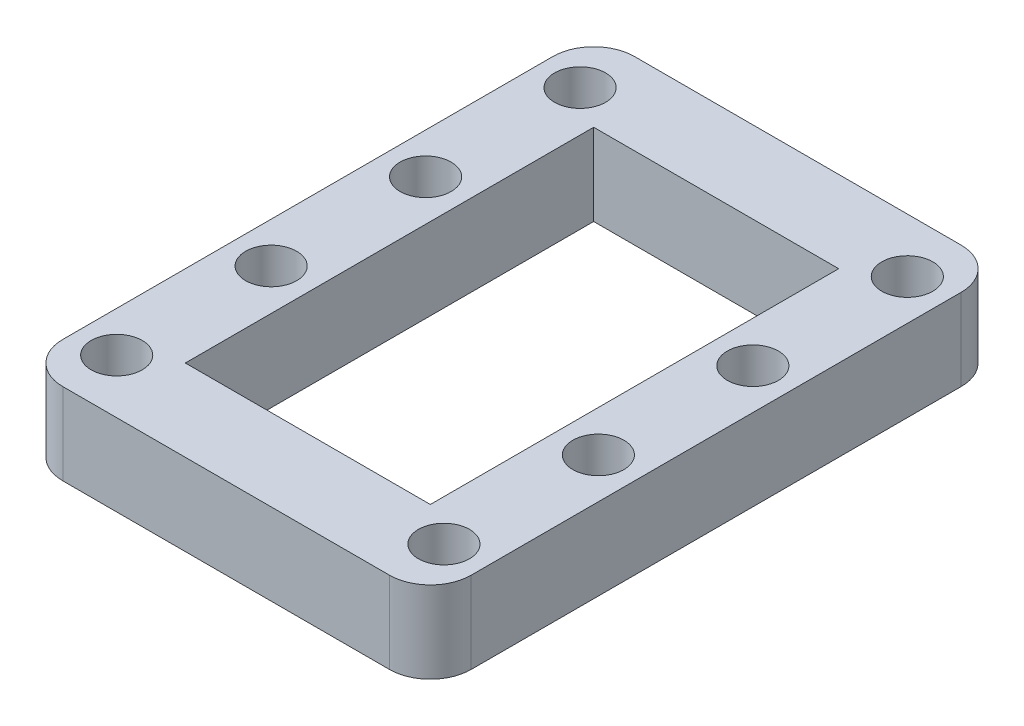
ISO-10303-21;
HEADER;
FILE_DESCRIPTION(('STEP AP214'),'2;1');
FILE_NAME('part.step','',(''),(''),'','','');
FILE_SCHEMA(('AUTOMOTIVE_DESIGN { 1 0 10303 214 1 1 1 1 }'));
ENDSEC;
DATA;
#1=APPLICATION_CONTEXT('core data for automotive mechanical design processes');
#2=APPLICATION_PROTOCOL_DEFINITION('international standard','automotive_design',2000,#1);
#3=PRODUCT_CONTEXT('',#1,'mechanical');
#4=PRODUCT('Part','Part','',(#3));
#5=PRODUCT_RELATED_PRODUCT_CATEGORY('part','',(#4));
#6=PRODUCT_DEFINITION_FORMATION('','',#4);
#7=PRODUCT_DEFINITION_CONTEXT('part definition',#1,'design');
#8=PRODUCT_DEFINITION('design','',#6,#7);
#9=PRODUCT_DEFINITION_SHAPE('','',#8);
#10=(LENGTH_UNIT() NAMED_UNIT(*) SI_UNIT(.MILLI.,.METRE.));
#11=(NAMED_UNIT(*) PLANE_ANGLE_UNIT() SI_UNIT($,.RADIAN.));
#12=(NAMED_UNIT(*) SI_UNIT($,.STERADIAN.) SOLID_ANGLE_UNIT());
#13=UNCERTAINTY_MEASURE_WITH_UNIT(LENGTH_MEASURE(1.E-05),#10,'distance_accuracy_value','');
#14=(GEOMETRIC_REPRESENTATION_CONTEXT(3) GLOBAL_UNCERTAINTY_ASSIGNED_CONTEXT((#13)) GLOBAL_UNIT_ASSIGNED_CONTEXT((#10,
#11,#12)) REPRESENTATION_CONTEXT('',''));
#15=CARTESIAN_POINT('',(0.,0.,0.));
#16=DIRECTION('',(0.,0.,1.));
#17=DIRECTION('',(1.,0.,0.));
#18=AXIS2_PLACEMENT_3D('',#15,#16,#17);
#19=CARTESIAN_POINT('',(0.,8.,0.));
#20=DIRECTION('',(0.,1.,0.));
#21=DIRECTION('',(1.,0.,0.));
#22=AXIS2_PLACEMENT_3D('',#19,#20,#21);
#23=PLANE('',#22);
#24=CARTESIAN_POINT('',(-16.0270440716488,8.,22.695));
#25=DIRECTION('',(0.,1.,0.));
#26=DIRECTION('',(0.,0.,1.));
#27=AXIS2_PLACEMENT_3D('',#24,#25,#26);
#28=CIRCLE('',#27,2.49999999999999);
#29=CARTESIAN_POINT('',(-16.0270440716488,8.,25.195));
#30=VERTEX_POINT('',#29);
#31=EDGE_CURVE('E493',#30,#30,#28,.T.);
#32=ORIENTED_EDGE('',*,*,#31,.F.);
#33=EDGE_LOOP('',(#32));
#34=FACE_BOUND('',#33,.T.);
#35=CARTESIAN_POINT('',(16.0270440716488,8.,7.565));
#36=DIRECTION('',(0.,-1.,0.));
#37=DIRECTION('',(0.,0.,-1.));
#38=AXIS2_PLACEMENT_3D('',#35,#36,#37);
#39=CIRCLE('',#38,2.50000000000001);
#40=CARTESIAN_POINT('',(16.0270440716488,8.,5.06499999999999));
#41=VERTEX_POINT('',#40);
#42=EDGE_CURVE('E507',#41,#41,#39,.T.);
#43=ORIENTED_EDGE('',*,*,#42,.T.);
#44=EDGE_LOOP('',(#43));
#45=FACE_BOUND('',#44,.T.);
#46=CARTESIAN_POINT('',(16.0270440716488,8.,-22.695));
#47=DIRECTION('',(0.,-1.,0.));
#48=DIRECTION('',(0.,0.,-1.));
#49=AXIS2_PLACEMENT_3D('',#46,#47,#48);
#50=CIRCLE('',#49,2.50000000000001);
#51=CARTESIAN_POINT('',(16.0270440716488,8.,-25.195));
#52=VERTEX_POINT('',#51);
#53=EDGE_CURVE('E539',#52,#52,#50,.T.);
#54=ORIENTED_EDGE('',*,*,#53,.T.);
#55=EDGE_LOOP('',(#54));
#56=FACE_BOUND('',#55,.T.);
#57=CARTESIAN_POINT('',(-16.0270440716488,8.,7.565));
#58=DIRECTION('',(0.,1.,0.));
#59=DIRECTION('',(0.,0.,1.));
#60=AXIS2_PLACEMENT_3D('',#57,#58,#59);
#61=CIRCLE('',#60,2.49999999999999);
#62=CARTESIAN_POINT('',(-16.0270440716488,8.,10.065));
#63=VERTEX_POINT('',#62);
#64=EDGE_CURVE('E286',#63,#63,#61,.T.);
#65=ORIENTED_EDGE('',*,*,#64,.F.);
#66=EDGE_LOOP('',(#65));
#67=FACE_BOUND('',#66,.T.);
#68=CARTESIAN_POINT('',(16.,8.,24.));
#69=DIRECTION('',(0.,1.,0.));
#70=DIRECTION('',(0.,0.,1.));
#71=AXIS2_PLACEMENT_3D('',#68,#69,#70);
#72=CIRCLE('',#71,4.);
#73=CARTESIAN_POINT('',(16.,8.,28.));
#74=VERTEX_POINT('',#73);
#75=CARTESIAN_POINT('',(20.,8.,24.));
#76=VERTEX_POINT('',#75);
#77=EDGE_CURVE('E164',#74,#76,#72,.T.);
#78=ORIENTED_EDGE('',*,*,#77,.T.);
#79=DIRECTION('',(0.,0.,-1.));
#80=VECTOR('',#79,1.);
#81=CARTESIAN_POINT('',(20.,8.,24.));
#82=LINE('',#81,#80);
#83=CARTESIAN_POINT('',(20.,8.,-24.));
#84=VERTEX_POINT('',#83);
#85=EDGE_CURVE('E160',#76,#84,#82,.T.);
#86=ORIENTED_EDGE('',*,*,#85,.T.);
#87=CARTESIAN_POINT('',(16.,8.,-24.));
#88=DIRECTION('',(0.,1.,0.));
#89=DIRECTION('',(0.,0.,1.));
#90=AXIS2_PLACEMENT_3D('',#87,#88,#89);
#91=CIRCLE('',#90,4.);
#92=CARTESIAN_POINT('',(16.,8.,-28.));
#93=VERTEX_POINT('',#92);
#94=EDGE_CURVE('E115',#84,#93,#91,.T.);
#95=ORIENTED_EDGE('',*,*,#94,.T.);
#96=DIRECTION('',(-1.,0.,0.));
#97=VECTOR('',#96,1.);
#98=CARTESIAN_POINT('',(16.,8.,-28.));
#99=LINE('',#98,#97);
#100=CARTESIAN_POINT('',(-16.,8.,-28.));
#101=VERTEX_POINT('',#100);
#102=EDGE_CURVE('E42',#93,#101,#99,.T.);
#103=ORIENTED_EDGE('',*,*,#102,.T.);
#104=CARTESIAN_POINT('',(-16.,8.,-24.));
#105=DIRECTION('',(0.,1.,0.));
#106=DIRECTION('',(0.,0.,-1.));
#107=AXIS2_PLACEMENT_3D('',#104,#105,#106);
#108=CIRCLE('',#107,4.);
#109=CARTESIAN_POINT('',(-20.,8.,-24.));
#110=VERTEX_POINT('',#109);
#111=EDGE_CURVE('E203',#101,#110,#108,.T.);
#112=ORIENTED_EDGE('',*,*,#111,.T.);
#113=DIRECTION('',(0.,0.,1.));
#114=VECTOR('',#113,1.);
#115=CARTESIAN_POINT('',(-20.,8.,-24.));
#116=LINE('',#115,#114);
#117=CARTESIAN_POINT('',(-20.,8.,24.));
#118=VERTEX_POINT('',#117);
#119=EDGE_CURVE('E174',#110,#118,#116,.T.);
#120=ORIENTED_EDGE('',*,*,#119,.T.);
#121=CARTESIAN_POINT('',(-16.,8.,24.));
#122=DIRECTION('',(0.,1.,0.));
#123=DIRECTION('',(0.,0.,-1.));
#124=AXIS2_PLACEMENT_3D('',#121,#122,#123);
#125=CIRCLE('',#124,4.);
#126=CARTESIAN_POINT('',(-16.,8.,28.));
#127=VERTEX_POINT('',#126);
#128=EDGE_CURVE('E172',#118,#127,#125,.T.);
#129=ORIENTED_EDGE('',*,*,#128,.T.);
#130=DIRECTION('',(1.,0.,0.));
#131=VECTOR('',#130,1.);
#132=CARTESIAN_POINT('',(-16.,8.,28.));
#133=LINE('',#132,#131);
#134=EDGE_CURVE('E132',#127,#74,#133,.T.);
#135=ORIENTED_EDGE('',*,*,#134,.T.);
#136=EDGE_LOOP('',(#78,#86,#95,#103,#112,#120,#129,#135));
#137=FACE_BOUND('',#136,.T.);
#138=DIRECTION('',(1.,0.,0.));
#139=VECTOR('',#138,1.);
#140=CARTESIAN_POINT('',(-16.,8.,-20.));
#141=LINE('',#140,#139);
#142=CARTESIAN_POINT('',(-12.,8.,-20.));
#143=VERTEX_POINT('',#142);
#144=CARTESIAN_POINT('',(12.,8.,-20.));
#145=VERTEX_POINT('',#144);
#146=EDGE_CURVE('E219',#143,#145,#141,.T.);
#147=ORIENTED_EDGE('',*,*,#146,.T.);
#148=DIRECTION('',(0.,0.,1.));
#149=VECTOR('',#148,1.);
#150=CARTESIAN_POINT('',(12.,8.,-24.));
#151=LINE('',#150,#149);
#152=CARTESIAN_POINT('',(12.,8.,20.));
#153=VERTEX_POINT('',#152);
#154=EDGE_CURVE('E221',#145,#153,#151,.T.);
#155=ORIENTED_EDGE('',*,*,#154,.T.);
#156=DIRECTION('',(-1.,0.,0.));
#157=VECTOR('',#156,1.);
#158=CARTESIAN_POINT('',(16.,8.,20.));
#159=LINE('',#158,#157);
#160=CARTESIAN_POINT('',(-12.,8.,20.));
#161=VERTEX_POINT('',#160);
#162=EDGE_CURVE('E157',#153,#161,#159,.T.);
#163=ORIENTED_EDGE('',*,*,#162,.T.);
#164=DIRECTION('',(0.,0.,-1.));
#165=VECTOR('',#164,1.);
#166=CARTESIAN_POINT('',(-12.,8.,24.));
#167=LINE('',#166,#165);
#168=EDGE_CURVE('E177',#161,#143,#167,.T.);
#169=ORIENTED_EDGE('',*,*,#168,.T.);
#170=EDGE_LOOP('',(#147,#155,#163,#169));
#171=FACE_BOUND('',#170,.T.);
#172=CARTESIAN_POINT('',(-16.0270440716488,8.,-22.695));
#173=DIRECTION('',(0.,1.,0.));
#174=DIRECTION('',(0.,0.,1.));
#175=AXIS2_PLACEMENT_3D('',#172,#173,#174);
#176=CIRCLE('',#175,2.49999999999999);
#177=CARTESIAN_POINT('',(-16.0270440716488,8.,-20.195));
#178=VERTEX_POINT('',#177);
#179=EDGE_CURVE('E532',#178,#178,#176,.T.);
#180=ORIENTED_EDGE('',*,*,#179,.F.);
#181=EDGE_LOOP('',(#180));
#182=FACE_BOUND('',#181,.T.);
#183=CARTESIAN_POINT('',(-16.0270440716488,8.,-7.565));
#184=DIRECTION('',(0.,1.,0.));
#185=DIRECTION('',(0.,0.,1.));
#186=AXIS2_PLACEMENT_3D('',#183,#184,#185);
#187=CIRCLE('',#186,2.49999999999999);
#188=CARTESIAN_POINT('',(-16.0270440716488,8.,-5.065));
#189=VERTEX_POINT('',#188);
#190=EDGE_CURVE('E518',#189,#189,#187,.T.);
#191=ORIENTED_EDGE('',*,*,#190,.F.);
#192=EDGE_LOOP('',(#191));
#193=FACE_BOUND('',#192,.T.);
#194=CARTESIAN_POINT('',(16.0270440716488,8.,-7.565));
#195=DIRECTION('',(0.,-1.,0.));
#196=DIRECTION('',(0.,0.,-1.));
#197=AXIS2_PLACEMENT_3D('',#194,#195,#196);
#198=CIRCLE('',#197,2.50000000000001);
#199=CARTESIAN_POINT('',(16.0270440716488,8.,-10.065));
#200=VERTEX_POINT('',#199);
#201=EDGE_CURVE('E513',#200,#200,#198,.T.);
#202=ORIENTED_EDGE('',*,*,#201,.T.);
#203=EDGE_LOOP('',(#202));
#204=FACE_BOUND('',#203,.T.);
#205=CARTESIAN_POINT('',(16.0270440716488,8.,22.695));
#206=DIRECTION('',(0.,-1.,0.));
#207=DIRECTION('',(0.,0.,-1.));
#208=AXIS2_PLACEMENT_3D('',#205,#206,#207);
#209=CIRCLE('',#208,2.50000000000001);
#210=CARTESIAN_POINT('',(16.0270440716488,8.,20.195));
#211=VERTEX_POINT('',#210);
#212=EDGE_CURVE('E496',#211,#211,#209,.T.);
#213=ORIENTED_EDGE('',*,*,#212,.T.);
#214=EDGE_LOOP('',(#213));
#215=FACE_BOUND('',#214,.T.);
#216=ADVANCED_FACE('F38',(#34,#45,#56,#67,#137,#171,#182,#193,#204,#215),#23,.T.);
#217=CARTESIAN_POINT('',(0.,0.,0.));
#218=DIRECTION('',(0.,1.,0.));
#219=DIRECTION('',(1.,0.,0.));
#220=AXIS2_PLACEMENT_3D('',#217,#218,#219);
#221=PLANE('',#220);
#222=CARTESIAN_POINT('',(-16.0270440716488,0.,22.695));
#223=DIRECTION('',(0.,1.,0.));
#224=DIRECTION('',(0.,0.,1.));
#225=AXIS2_PLACEMENT_3D('',#222,#223,#224);
#226=CIRCLE('',#225,2.49999999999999);
#227=CARTESIAN_POINT('',(-16.0270440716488,0.,25.195));
#228=VERTEX_POINT('',#227);
#229=EDGE_CURVE('E491',#228,#228,#226,.T.);
#230=ORIENTED_EDGE('',*,*,#229,.T.);
#231=EDGE_LOOP('',(#230));
#232=FACE_BOUND('',#231,.T.);
#233=CARTESIAN_POINT('',(-16.0270440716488,0.,-7.565));
#234=DIRECTION('',(0.,1.,0.));
#235=DIRECTION('',(0.,0.,1.));
#236=AXIS2_PLACEMENT_3D('',#233,#234,#235);
#237=CIRCLE('',#236,2.49999999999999);
#238=CARTESIAN_POINT('',(-16.0270440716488,0.,-5.065));
#239=VERTEX_POINT('',#238);
#240=EDGE_CURVE('E527',#239,#239,#237,.T.);
#241=ORIENTED_EDGE('',*,*,#240,.T.);
#242=EDGE_LOOP('',(#241));
#243=FACE_BOUND('',#242,.T.);
#244=CARTESIAN_POINT('',(-16.0270440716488,0.,-22.695));
#245=DIRECTION('',(0.,1.,0.));
#246=DIRECTION('',(0.,0.,1.));
#247=AXIS2_PLACEMENT_3D('',#244,#245,#246);
#248=CIRCLE('',#247,2.49999999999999);
#249=CARTESIAN_POINT('',(-16.0270440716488,0.,-20.195));
#250=VERTEX_POINT('',#249);
#251=EDGE_CURVE('E537',#250,#250,#248,.T.);
#252=ORIENTED_EDGE('',*,*,#251,.T.);
#253=EDGE_LOOP('',(#252));
#254=FACE_BOUND('',#253,.T.);
#255=CARTESIAN_POINT('',(-16.0270440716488,0.,7.565));
#256=DIRECTION('',(0.,1.,0.));
#257=DIRECTION('',(0.,0.,1.));
#258=AXIS2_PLACEMENT_3D('',#255,#256,#257);
#259=CIRCLE('',#258,2.49999999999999);
#260=CARTESIAN_POINT('',(-16.0270440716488,0.,10.065));
#261=VERTEX_POINT('',#260);
#262=EDGE_CURVE('E179',#261,#261,#259,.T.);
#263=ORIENTED_EDGE('',*,*,#262,.T.);
#264=EDGE_LOOP('',(#263));
#265=FACE_BOUND('',#264,.T.);
#266=CARTESIAN_POINT('',(16.,0.,24.));
#267=DIRECTION('',(0.,1.,0.));
#268=DIRECTION('',(0.,0.,1.));
#269=AXIS2_PLACEMENT_3D('',#266,#267,#268);
#270=CIRCLE('',#269,4.);
#271=CARTESIAN_POINT('',(16.,0.,28.));
#272=VERTEX_POINT('',#271);
#273=CARTESIAN_POINT('',(20.,0.,24.));
#274=VERTEX_POINT('',#273);
#275=EDGE_CURVE('E146',#272,#274,#270,.T.);
#276=ORIENTED_EDGE('',*,*,#275,.F.);
#277=DIRECTION('',(1.,0.,0.));
#278=VECTOR('',#277,1.);
#279=CARTESIAN_POINT('',(-16.,0.,28.));
#280=LINE('',#279,#278);
#281=CARTESIAN_POINT('',(-16.,0.,28.));
#282=VERTEX_POINT('',#281);
#283=EDGE_CURVE('E130',#282,#272,#280,.T.);
#284=ORIENTED_EDGE('',*,*,#283,.F.);
#285=CARTESIAN_POINT('',(-16.,0.,24.));
#286=DIRECTION('',(0.,1.,0.));
#287=DIRECTION('',(0.,0.,-1.));
#288=AXIS2_PLACEMENT_3D('',#285,#286,#287);
#289=CIRCLE('',#288,4.);
#290=CARTESIAN_POINT('',(-20.,0.,24.));
#291=VERTEX_POINT('',#290);
#292=EDGE_CURVE('E136',#291,#282,#289,.T.);
#293=ORIENTED_EDGE('',*,*,#292,.F.);
#294=DIRECTION('',(0.,0.,1.));
#295=VECTOR('',#294,1.);
#296=CARTESIAN_POINT('',(-20.,0.,-24.));
#297=LINE('',#296,#295);
#298=CARTESIAN_POINT('',(-20.,0.,-24.));
#299=VERTEX_POINT('',#298);
#300=EDGE_CURVE('E137',#299,#291,#297,.T.);
#301=ORIENTED_EDGE('',*,*,#300,.F.);
#302=CARTESIAN_POINT('',(-16.,0.,-24.));
#303=DIRECTION('',(0.,1.,0.));
#304=DIRECTION('',(0.,0.,-1.));
#305=AXIS2_PLACEMENT_3D('',#302,#303,#304);
#306=CIRCLE('',#305,4.);
#307=CARTESIAN_POINT('',(-16.,0.,-28.));
#308=VERTEX_POINT('',#307);
#309=EDGE_CURVE('E207',#308,#299,#306,.T.);
#310=ORIENTED_EDGE('',*,*,#309,.F.);
#311=DIRECTION('',(-1.,0.,0.));
#312=VECTOR('',#311,1.);
#313=CARTESIAN_POINT('',(16.,0.,-28.));
#314=LINE('',#313,#312);
#315=CARTESIAN_POINT('',(16.,0.,-28.));
#316=VERTEX_POINT('',#315);
#317=EDGE_CURVE('E216',#316,#308,#314,.T.);
#318=ORIENTED_EDGE('',*,*,#317,.F.);
#319=CARTESIAN_POINT('',(16.,0.,-24.));
#320=DIRECTION('',(0.,1.,0.));
#321=DIRECTION('',(0.,0.,1.));
#322=AXIS2_PLACEMENT_3D('',#319,#320,#321);
#323=CIRCLE('',#322,4.);
#324=CARTESIAN_POINT('',(20.,0.,-24.));
#325=VERTEX_POINT('',#324);
#326=EDGE_CURVE('E197',#325,#316,#323,.T.);
#327=ORIENTED_EDGE('',*,*,#326,.F.);
#328=DIRECTION('',(0.,0.,-1.));
#329=VECTOR('',#328,1.);
#330=CARTESIAN_POINT('',(20.,0.,24.));
#331=LINE('',#330,#329);
#332=EDGE_CURVE('E171',#274,#325,#331,.T.);
#333=ORIENTED_EDGE('',*,*,#332,.F.);
#334=EDGE_LOOP('',(#276,#284,#293,#301,#310,#318,#327,#333));
#335=FACE_BOUND('',#334,.T.);
#336=DIRECTION('',(1.,0.,0.));
#337=VECTOR('',#336,1.);
#338=CARTESIAN_POINT('',(-16.,0.,-20.));
#339=LINE('',#338,#337);
#340=CARTESIAN_POINT('',(-12.,0.,-20.));
#341=VERTEX_POINT('',#340);
#342=CARTESIAN_POINT('',(12.,0.,-20.));
#343=VERTEX_POINT('',#342);
#344=EDGE_CURVE('E191',#341,#343,#339,.T.);
#345=ORIENTED_EDGE('',*,*,#344,.F.);
#346=DIRECTION('',(0.,0.,-1.));
#347=VECTOR('',#346,1.);
#348=CARTESIAN_POINT('',(-12.,0.,24.));
#349=LINE('',#348,#347);
#350=CARTESIAN_POINT('',(-12.,0.,20.));
#351=VERTEX_POINT('',#350);
#352=EDGE_CURVE('E11',#351,#341,#349,.T.);
#353=ORIENTED_EDGE('',*,*,#352,.F.);
#354=DIRECTION('',(-1.,0.,0.));
#355=VECTOR('',#354,1.);
#356=CARTESIAN_POINT('',(16.,0.,20.));
#357=LINE('',#356,#355);
#358=CARTESIAN_POINT('',(12.,0.,20.));
#359=VERTEX_POINT('',#358);
#360=EDGE_CURVE('E165',#359,#351,#357,.T.);
#361=ORIENTED_EDGE('',*,*,#360,.F.);
#362=DIRECTION('',(0.,0.,1.));
#363=VECTOR('',#362,1.);
#364=CARTESIAN_POINT('',(12.,0.,-24.));
#365=LINE('',#364,#363);
#366=EDGE_CURVE('E181',#343,#359,#365,.T.);
#367=ORIENTED_EDGE('',*,*,#366,.F.);
#368=EDGE_LOOP('',(#345,#353,#361,#367));
#369=FACE_BOUND('',#368,.T.);
#370=CARTESIAN_POINT('',(16.0270440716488,0.,-22.695));
#371=DIRECTION('',(0.,-1.,0.));
#372=DIRECTION('',(0.,0.,-1.));
#373=AXIS2_PLACEMENT_3D('',#370,#371,#372);
#374=CIRCLE('',#373,2.50000000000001);
#375=CARTESIAN_POINT('',(16.0270440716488,0.,-25.195));
#376=VERTEX_POINT('',#375);
#377=EDGE_CURVE('E499',#376,#376,#374,.T.);
#378=ORIENTED_EDGE('',*,*,#377,.F.);
#379=EDGE_LOOP('',(#378));
#380=FACE_BOUND('',#379,.T.);
#381=CARTESIAN_POINT('',(16.0270440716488,0.,-7.565));
#382=DIRECTION('',(0.,-1.,0.));
#383=DIRECTION('',(0.,0.,-1.));
#384=AXIS2_PLACEMENT_3D('',#381,#382,#383);
#385=CIRCLE('',#384,2.50000000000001);
#386=CARTESIAN_POINT('',(16.0270440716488,0.,-10.065));
#387=VERTEX_POINT('',#386);
#388=EDGE_CURVE('E516',#387,#387,#385,.T.);
#389=ORIENTED_EDGE('',*,*,#388,.F.);
#390=EDGE_LOOP('',(#389));
#391=FACE_BOUND('',#390,.T.);
#392=CARTESIAN_POINT('',(16.0270440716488,0.,7.565));
#393=DIRECTION('',(0.,-1.,0.));
#394=DIRECTION('',(0.,0.,-1.));
#395=AXIS2_PLACEMENT_3D('',#392,#393,#394);
#396=CIRCLE('',#395,2.50000000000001);
#397=CARTESIAN_POINT('',(16.0270440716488,0.,5.06499999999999));
#398=VERTEX_POINT('',#397);
#399=EDGE_CURVE('E510',#398,#398,#396,.T.);
#400=ORIENTED_EDGE('',*,*,#399,.F.);
#401=EDGE_LOOP('',(#400));
#402=FACE_BOUND('',#401,.T.);
#403=CARTESIAN_POINT('',(16.0270440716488,0.,22.695));
#404=DIRECTION('',(0.,-1.,0.));
#405=DIRECTION('',(0.,0.,-1.));
#406=AXIS2_PLACEMENT_3D('',#403,#404,#405);
#407=CIRCLE('',#406,2.50000000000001);
#408=CARTESIAN_POINT('',(16.0270440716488,0.,20.195));
#409=VERTEX_POINT('',#408);
#410=EDGE_CURVE('E504',#409,#409,#407,.T.);
#411=ORIENTED_EDGE('',*,*,#410,.F.);
#412=EDGE_LOOP('',(#411));
#413=FACE_BOUND('',#412,.T.);
#414=ADVANCED_FACE('F140',(#232,#243,#254,#265,#335,#369,#380,#391,#402,#413),#221,.F.);
#415=CARTESIAN_POINT('',(-12.,0.,20.));
#416=DIRECTION('',(1.,0.,0.));
#417=DIRECTION('',(0.,1.,0.));
#418=AXIS2_PLACEMENT_3D('',#415,#416,#417);
#419=PLANE('',#418);
#420=ORIENTED_EDGE('',*,*,#352,.T.);
#421=DIRECTION('',(0.,1.,0.));
#422=VECTOR('',#421,1.);
#423=CARTESIAN_POINT('',(-12.,0.,-20.));
#424=LINE('',#423,#422);
#425=EDGE_CURVE('E48',#341,#143,#424,.T.);
#426=ORIENTED_EDGE('',*,*,#425,.T.);
#427=ORIENTED_EDGE('',*,*,#168,.F.);
#428=DIRECTION('',(0.,1.,0.));
#429=VECTOR('',#428,1.);
#430=CARTESIAN_POINT('',(-12.,0.,20.));
#431=LINE('',#430,#429);
#432=EDGE_CURVE('E168',#351,#161,#431,.T.);
#433=ORIENTED_EDGE('',*,*,#432,.F.);
#434=EDGE_LOOP('',(#420,#426,#427,#433));
#435=FACE_BOUND('',#434,.T.);
#436=ADVANCED_FACE('F256',(#435),#419,.T.);
#437=CARTESIAN_POINT('',(12.,0.,20.));
#438=DIRECTION('',(0.,0.,-1.));
#439=DIRECTION('',(0.,-1.,0.));
#440=AXIS2_PLACEMENT_3D('',#437,#438,#439);
#441=PLANE('',#440);
#442=ORIENTED_EDGE('',*,*,#360,.T.);
#443=ORIENTED_EDGE('',*,*,#432,.T.);
#444=ORIENTED_EDGE('',*,*,#162,.F.);
#445=DIRECTION('',(0.,1.,0.));
#446=VECTOR('',#445,1.);
#447=CARTESIAN_POINT('',(12.,0.,20.));
#448=LINE('',#447,#446);
#449=EDGE_CURVE('E186',#359,#153,#448,.T.);
#450=ORIENTED_EDGE('',*,*,#449,.F.);
#451=EDGE_LOOP('',(#442,#443,#444,#450));
#452=FACE_BOUND('',#451,.T.);
#453=ADVANCED_FACE('F269',(#452),#441,.T.);
#454=CARTESIAN_POINT('',(12.,0.,-20.));
#455=DIRECTION('',(-1.,0.,0.));
#456=DIRECTION('',(0.,0.,1.));
#457=AXIS2_PLACEMENT_3D('',#454,#455,#456);
#458=PLANE('',#457);
#459=ORIENTED_EDGE('',*,*,#366,.T.);
#460=ORIENTED_EDGE('',*,*,#449,.T.);
#461=ORIENTED_EDGE('',*,*,#154,.F.);
#462=DIRECTION('',(0.,1.,0.));
#463=VECTOR('',#462,1.);
#464=CARTESIAN_POINT('',(12.,0.,-20.));
#465=LINE('',#464,#463);
#466=EDGE_CURVE('E147',#343,#145,#465,.T.);
#467=ORIENTED_EDGE('',*,*,#466,.F.);
#468=EDGE_LOOP('',(#459,#460,#461,#467));
#469=FACE_BOUND('',#468,.T.);
#470=ADVANCED_FACE('F266',(#469),#458,.T.);
#471=CARTESIAN_POINT('',(-12.,0.,-20.));
#472=DIRECTION('',(0.,0.,1.));
#473=DIRECTION('',(1.,0.,0.));
#474=AXIS2_PLACEMENT_3D('',#471,#472,#473);
#475=PLANE('',#474);
#476=ORIENTED_EDGE('',*,*,#344,.T.);
#477=ORIENTED_EDGE('',*,*,#466,.T.);
#478=ORIENTED_EDGE('',*,*,#146,.F.);
#479=ORIENTED_EDGE('',*,*,#425,.F.);
#480=EDGE_LOOP('',(#476,#477,#478,#479));
#481=FACE_BOUND('',#480,.T.);
#482=ADVANCED_FACE('F265',(#481),#475,.T.);
#483=CARTESIAN_POINT('',(-16.,0.,28.));
#484=DIRECTION('',(0.,0.,1.));
#485=DIRECTION('',(1.,0.,0.));
#486=AXIS2_PLACEMENT_3D('',#483,#484,#485);
#487=PLANE('',#486);
#488=ORIENTED_EDGE('',*,*,#283,.T.);
#489=DIRECTION('',(0.,1.,0.));
#490=VECTOR('',#489,1.);
#491=CARTESIAN_POINT('',(16.,0.,28.));
#492=LINE('',#491,#490);
#493=EDGE_CURVE('E148',#272,#74,#492,.T.);
#494=ORIENTED_EDGE('',*,*,#493,.T.);
#495=ORIENTED_EDGE('',*,*,#134,.F.);
#496=DIRECTION('',(0.,1.,0.));
#497=VECTOR('',#496,1.);
#498=CARTESIAN_POINT('',(-16.,0.,28.));
#499=LINE('',#498,#497);
#500=EDGE_CURVE('E126',#282,#127,#499,.T.);
#501=ORIENTED_EDGE('',*,*,#500,.F.);
#502=EDGE_LOOP('',(#488,#494,#495,#501));
#503=FACE_BOUND('',#502,.T.);
#504=ADVANCED_FACE('F128',(#503),#487,.T.);
#505=CARTESIAN_POINT('',(-16.,0.,24.));
#506=DIRECTION('',(0.,1.,0.));
#507=DIRECTION('',(0.,0.,-1.));
#508=AXIS2_PLACEMENT_3D('',#505,#506,#507);
#509=CYLINDRICAL_SURFACE('',#508,4.);
#510=ORIENTED_EDGE('',*,*,#292,.T.);
#511=ORIENTED_EDGE('',*,*,#500,.T.);
#512=ORIENTED_EDGE('',*,*,#128,.F.);
#513=DIRECTION('',(0.,1.,0.));
#514=VECTOR('',#513,1.);
#515=CARTESIAN_POINT('',(-20.,0.,24.));
#516=LINE('',#515,#514);
#517=EDGE_CURVE('E152',#291,#118,#516,.T.);
#518=ORIENTED_EDGE('',*,*,#517,.F.);
#519=EDGE_LOOP('',(#510,#511,#512,#518));
#520=FACE_BOUND('',#519,.T.);
#521=ADVANCED_FACE('F150',(#520),#509,.T.);
#522=CARTESIAN_POINT('',(-20.,0.,-24.));
#523=DIRECTION('',(-1.,0.,0.));
#524=DIRECTION('',(0.,1.,0.));
#525=AXIS2_PLACEMENT_3D('',#522,#523,#524);
#526=PLANE('',#525);
#527=ORIENTED_EDGE('',*,*,#300,.T.);
#528=ORIENTED_EDGE('',*,*,#517,.T.);
#529=ORIENTED_EDGE('',*,*,#119,.F.);
#530=DIRECTION('',(0.,1.,0.));
#531=VECTOR('',#530,1.);
#532=CARTESIAN_POINT('',(-20.,0.,-24.));
#533=LINE('',#532,#531);
#534=EDGE_CURVE('E209',#299,#110,#533,.T.);
#535=ORIENTED_EDGE('',*,*,#534,.F.);
#536=EDGE_LOOP('',(#527,#528,#529,#535));
#537=FACE_BOUND('',#536,.T.);
#538=ADVANCED_FACE('F271',(#537),#526,.T.);
#539=CARTESIAN_POINT('',(-16.,0.,-24.));
#540=DIRECTION('',(0.,1.,0.));
#541=DIRECTION('',(0.,0.,-1.));
#542=AXIS2_PLACEMENT_3D('',#539,#540,#541);
#543=CYLINDRICAL_SURFACE('',#542,4.);
#544=ORIENTED_EDGE('',*,*,#309,.T.);
#545=ORIENTED_EDGE('',*,*,#534,.T.);
#546=ORIENTED_EDGE('',*,*,#111,.F.);
#547=DIRECTION('',(0.,1.,0.));
#548=VECTOR('',#547,1.);
#549=CARTESIAN_POINT('',(-16.,0.,-28.));
#550=LINE('',#549,#548);
#551=EDGE_CURVE('E195',#308,#101,#550,.T.);
#552=ORIENTED_EDGE('',*,*,#551,.F.);
#553=EDGE_LOOP('',(#544,#545,#546,#552));
#554=FACE_BOUND('',#553,.T.);
#555=ADVANCED_FACE('F275',(#554),#543,.T.);
#556=CARTESIAN_POINT('',(16.,0.,-28.));
#557=DIRECTION('',(0.,0.,-1.));
#558=DIRECTION('',(0.,-1.,0.));
#559=AXIS2_PLACEMENT_3D('',#556,#557,#558);
#560=PLANE('',#559);
#561=ORIENTED_EDGE('',*,*,#317,.T.);
#562=ORIENTED_EDGE('',*,*,#551,.T.);
#563=ORIENTED_EDGE('',*,*,#102,.F.);
#564=DIRECTION('',(0.,1.,0.));
#565=VECTOR('',#564,1.);
#566=CARTESIAN_POINT('',(16.,0.,-28.));
#567=LINE('',#566,#565);
#568=EDGE_CURVE('E108',#316,#93,#567,.T.);
#569=ORIENTED_EDGE('',*,*,#568,.F.);
#570=EDGE_LOOP('',(#561,#562,#563,#569));
#571=FACE_BOUND('',#570,.T.);
#572=ADVANCED_FACE('F225',(#571),#560,.T.);
#573=CARTESIAN_POINT('',(16.,0.,-24.));
#574=DIRECTION('',(0.,1.,0.));
#575=DIRECTION('',(0.,0.,1.));
#576=AXIS2_PLACEMENT_3D('',#573,#574,#575);
#577=CYLINDRICAL_SURFACE('',#576,4.);
#578=ORIENTED_EDGE('',*,*,#326,.T.);
#579=ORIENTED_EDGE('',*,*,#568,.T.);
#580=ORIENTED_EDGE('',*,*,#94,.F.);
#581=DIRECTION('',(0.,1.,0.));
#582=VECTOR('',#581,1.);
#583=CARTESIAN_POINT('',(20.,0.,-24.));
#584=LINE('',#583,#582);
#585=EDGE_CURVE('E169',#325,#84,#584,.T.);
#586=ORIENTED_EDGE('',*,*,#585,.F.);
#587=EDGE_LOOP('',(#578,#579,#580,#586));
#588=FACE_BOUND('',#587,.T.);
#589=ADVANCED_FACE('F40',(#588),#577,.T.);
#590=CARTESIAN_POINT('',(20.,0.,24.));
#591=DIRECTION('',(1.,0.,0.));
#592=DIRECTION('',(0.,1.,0.));
#593=AXIS2_PLACEMENT_3D('',#590,#591,#592);
#594=PLANE('',#593);
#595=ORIENTED_EDGE('',*,*,#332,.T.);
#596=ORIENTED_EDGE('',*,*,#585,.T.);
#597=ORIENTED_EDGE('',*,*,#85,.F.);
#598=DIRECTION('',(0.,1.,0.));
#599=VECTOR('',#598,1.);
#600=CARTESIAN_POINT('',(20.,0.,24.));
#601=LINE('',#600,#599);
#602=EDGE_CURVE('E161',#274,#76,#601,.T.);
#603=ORIENTED_EDGE('',*,*,#602,.F.);
#604=EDGE_LOOP('',(#595,#596,#597,#603));
#605=FACE_BOUND('',#604,.T.);
#606=ADVANCED_FACE('F235',(#605),#594,.T.);
#607=CARTESIAN_POINT('',(16.,0.,24.));
#608=DIRECTION('',(0.,1.,0.));
#609=DIRECTION('',(0.,0.,1.));
#610=AXIS2_PLACEMENT_3D('',#607,#608,#609);
#611=CYLINDRICAL_SURFACE('',#610,4.);
#612=ORIENTED_EDGE('',*,*,#275,.T.);
#613=ORIENTED_EDGE('',*,*,#602,.T.);
#614=ORIENTED_EDGE('',*,*,#77,.F.);
#615=ORIENTED_EDGE('',*,*,#493,.F.);
#616=EDGE_LOOP('',(#612,#613,#614,#615));
#617=FACE_BOUND('',#616,.T.);
#618=ADVANCED_FACE('F237',(#617),#611,.T.);
#619=CARTESIAN_POINT('',(-16.0270440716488,0.,7.565));
#620=DIRECTION('',(0.,1.,0.));
#621=DIRECTION('',(0.,0.,1.));
#622=AXIS2_PLACEMENT_3D('',#619,#620,#621);
#623=CYLINDRICAL_SURFACE('',#622,2.49999999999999);
#624=ORIENTED_EDGE('',*,*,#262,.F.);
#625=EDGE_LOOP('',(#624));
#626=FACE_BOUND('',#625,.T.);
#627=ORIENTED_EDGE('',*,*,#64,.T.);
#628=EDGE_LOOP('',(#627));
#629=FACE_BOUND('',#628,.T.);
#630=ADVANCED_FACE('F239',(#626,#629),#623,.F.);
#631=CARTESIAN_POINT('',(16.0270440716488,0.,-22.695));
#632=DIRECTION('',(0.,1.,0.));
#633=DIRECTION('',(0.,0.,1.));
#634=AXIS2_PLACEMENT_3D('',#631,#632,#633);
#635=CYLINDRICAL_SURFACE('',#634,2.50000000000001);
#636=ORIENTED_EDGE('',*,*,#377,.T.);
#637=EDGE_LOOP('',(#636));
#638=FACE_BOUND('',#637,.T.);
#639=ORIENTED_EDGE('',*,*,#53,.F.);
#640=EDGE_LOOP('',(#639));
#641=FACE_BOUND('',#640,.T.);
#642=ADVANCED_FACE('F245',(#638,#641),#635,.F.);
#643=CARTESIAN_POINT('',(-16.0270440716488,0.,-22.695));
#644=DIRECTION('',(0.,1.,0.));
#645=DIRECTION('',(0.,0.,1.));
#646=AXIS2_PLACEMENT_3D('',#643,#644,#645);
#647=CYLINDRICAL_SURFACE('',#646,2.49999999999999);
#648=ORIENTED_EDGE('',*,*,#251,.F.);
#649=EDGE_LOOP('',(#648));
#650=FACE_BOUND('',#649,.T.);
#651=ORIENTED_EDGE('',*,*,#179,.T.);
#652=EDGE_LOOP('',(#651));
#653=FACE_BOUND('',#652,.T.);
#654=ADVANCED_FACE('F424',(#650,#653),#647,.F.);
#655=CARTESIAN_POINT('',(-16.0270440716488,0.,-7.565));
#656=DIRECTION('',(0.,1.,0.));
#657=DIRECTION('',(0.,0.,1.));
#658=AXIS2_PLACEMENT_3D('',#655,#656,#657);
#659=CYLINDRICAL_SURFACE('',#658,2.49999999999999);
#660=ORIENTED_EDGE('',*,*,#240,.F.);
#661=EDGE_LOOP('',(#660));
#662=FACE_BOUND('',#661,.T.);
#663=ORIENTED_EDGE('',*,*,#190,.T.);
#664=EDGE_LOOP('',(#663));
#665=FACE_BOUND('',#664,.T.);
#666=ADVANCED_FACE('F433',(#662,#665),#659,.F.);
#667=CARTESIAN_POINT('',(16.0270440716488,0.,-7.565));
#668=DIRECTION('',(0.,1.,0.));
#669=DIRECTION('',(0.,0.,1.));
#670=AXIS2_PLACEMENT_3D('',#667,#668,#669);
#671=CYLINDRICAL_SURFACE('',#670,2.50000000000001);
#672=ORIENTED_EDGE('',*,*,#388,.T.);
#673=EDGE_LOOP('',(#672));
#674=FACE_BOUND('',#673,.T.);
#675=ORIENTED_EDGE('',*,*,#201,.F.);
#676=EDGE_LOOP('',(#675));
#677=FACE_BOUND('',#676,.T.);
#678=ADVANCED_FACE('F442',(#674,#677),#671,.F.);
#679=CARTESIAN_POINT('',(16.0270440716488,0.,7.565));
#680=DIRECTION('',(0.,1.,0.));
#681=DIRECTION('',(0.,0.,1.));
#682=AXIS2_PLACEMENT_3D('',#679,#680,#681);
#683=CYLINDRICAL_SURFACE('',#682,2.50000000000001);
#684=ORIENTED_EDGE('',*,*,#399,.T.);
#685=EDGE_LOOP('',(#684));
#686=FACE_BOUND('',#685,.T.);
#687=ORIENTED_EDGE('',*,*,#42,.F.);
#688=EDGE_LOOP('',(#687));
#689=FACE_BOUND('',#688,.T.);
#690=ADVANCED_FACE('F451',(#686,#689),#683,.F.);
#691=CARTESIAN_POINT('',(16.0270440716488,0.,22.695));
#692=DIRECTION('',(0.,1.,0.));
#693=DIRECTION('',(0.,0.,1.));
#694=AXIS2_PLACEMENT_3D('',#691,#692,#693);
#695=CYLINDRICAL_SURFACE('',#694,2.50000000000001);
#696=ORIENTED_EDGE('',*,*,#410,.T.);
#697=EDGE_LOOP('',(#696));
#698=FACE_BOUND('',#697,.T.);
#699=ORIENTED_EDGE('',*,*,#212,.F.);
#700=EDGE_LOOP('',(#699));
#701=FACE_BOUND('',#700,.T.);
#702=ADVANCED_FACE('F460',(#698,#701),#695,.F.);
#703=CARTESIAN_POINT('',(-16.0270440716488,0.,22.695));
#704=DIRECTION('',(0.,1.,0.));
#705=DIRECTION('',(0.,0.,1.));
#706=AXIS2_PLACEMENT_3D('',#703,#704,#705);
#707=CYLINDRICAL_SURFACE('',#706,2.49999999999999);
#708=ORIENTED_EDGE('',*,*,#229,.F.);
#709=EDGE_LOOP('',(#708));
#710=FACE_BOUND('',#709,.T.);
#711=ORIENTED_EDGE('',*,*,#31,.T.);
#712=EDGE_LOOP('',(#711));
#713=FACE_BOUND('',#712,.T.);
#714=ADVANCED_FACE('F469',(#710,#713),#707,.F.);
#715=CLOSED_SHELL('',(#216,#414,#436,#453,#470,#482,#504,#521,#538,#555,#572,#589,#606,#618,
#630,#642,#654,#666,#678,#690,#702,#714));
#716=MANIFOLD_SOLID_BREP('B2',#715);
#717=ADVANCED_BREP_SHAPE_REPRESENTATION('',(#18,#716),#14);
#718=SHAPE_DEFINITION_REPRESENTATION(#9,#717);
ENDSEC;
END-ISO-10303-21;
